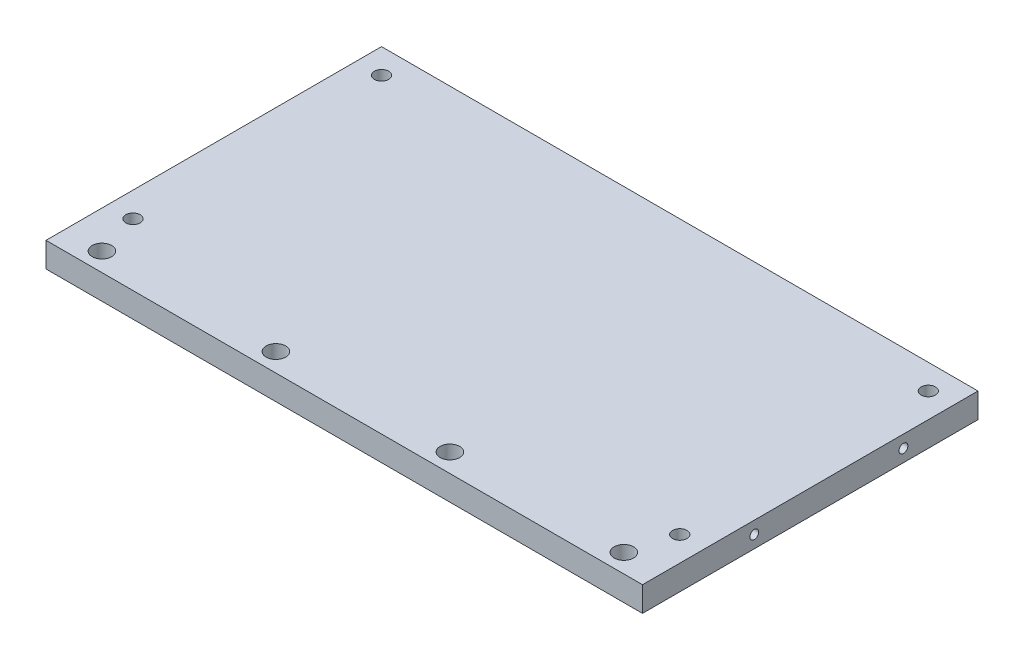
from build123d import *

# Parameters (mm, degrees)
SKETCH1_W          = 152.4
SKETCH1_H          = 85.725
EXTRUDE1_DEPTH     = 6.35
SKETCH2_R          = 1.8288
CUT_EXTRUDE1_DEPTH = 175.971020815
SKETCH3_R          = 2.4892
CUT_EXTRUDE2_DEPTH = 175.971020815
SKETCH4_R          = 1.1303
CUT_EXTRUDE3_DEPTH = 12.7
SKETCH5_R          = 1.1303
CUT_EXTRUDE4_DEPTH = 12.7
CUT_EXTRUDE5_START = -12.7
SKETCH6_R          = 1.1303
CUT_EXTRUDE5_DEPTH = 12.7


with BuildPart() as part:
    # Sketch1 → Extrude1 (new body)
    with BuildSketch(Plane(origin=(0, 0, 0), x_dir=(1, 0, 0), z_dir=(0, 1, 0))):
        with Locations((76.2, 42.8625)):
            Rectangle(SKETCH1_W, SKETCH1_H)
    extrude(amount=EXTRUDE1_DEPTH)

    # Sketch2 → Cut-Extrude1 (cut, through all)
    with BuildSketch(Plane(origin=(0, 6.35, 0), x_dir=(-1, 0, 0), z_dir=(0, 1, 0))):
        with Locations(Location((-6.35, -79.375, 0), (0, 0, 90))):
            Circle(SKETCH2_R)
        with Locations(Location((-146.05, -79.375, 0), (0, 0, 90))):
            Circle(SKETCH2_R)
        with Locations(Location((-6.35, -15.875, 0), (0, 0, 90))):
            Circle(SKETCH2_R)
        with Locations(Location((-146.05, -15.875, 0), (0, 0, 90))):
            Circle(SKETCH2_R)
    extrude(amount=-CUT_EXTRUDE1_DEPTH, mode=Mode.SUBTRACT)

    # Sketch3 → Cut-Extrude2 (cut, through all)
    with BuildSketch(Plane(origin=(0, 6.35, 0), x_dir=(-1, 0, 0), z_dir=(0, 1, 0))):
        with Locations(Location((-9.525, -4.7625, 0), (0, 0, 90))):
            Circle(SKETCH3_R)
        with Locations(Location((-53.975, -4.7625, 0), (0, 0, 90))):
            Circle(SKETCH3_R)
        with Locations(Location((-98.425, -4.7625, 0), (0, 0, 90))):
            Circle(SKETCH3_R)
        with Locations(Location((-142.875, -4.7625, 0), (0, 0, 90))):
            Circle(SKETCH3_R)
    extrude(amount=-CUT_EXTRUDE2_DEPTH, mode=Mode.SUBTRACT)

    # Sketch4 → Cut-Extrude3 (cut)
    with BuildSketch(Plane(origin=(152.4, 0, 0), x_dir=(0, 0, -1), z_dir=(1, 0, 0))):
        with Locations((28.575, 3.175)):
            Circle(SKETCH4_R)
        with Locations((66.675, 3.175)):
            Circle(SKETCH4_R)
    extrude(amount=-CUT_EXTRUDE3_DEPTH, mode=Mode.SUBTRACT)

    # Sketch5 → Cut-Extrude4 (cut)
    with BuildSketch(Plane(origin=(0, 0, -85.725), x_dir=(-1, 0, 0), z_dir=(0, 0, -1))):
        with Locations((-142.875, 3.175)):
            Circle(SKETCH5_R)
        with Locations((-98.425, 3.175)):
            Circle(SKETCH5_R)
        with Locations((-53.975, 3.175)):
            Circle(SKETCH5_R)
        with Locations((-9.525, 3.175)):
            Circle(SKETCH5_R)
    extrude(amount=-CUT_EXTRUDE4_DEPTH, mode=Mode.SUBTRACT)

    # Sketch6 → Cut-Extrude5 (cut)
    with BuildSketch(Plane.ZY.offset(CUT_EXTRUDE5_START)):
        with Locations(Location((-66.675, 3.175, 0), (0, 0, 180))):
            Circle(SKETCH6_R)
        with Locations(Location((-28.575, 3.175, 0), (0, 0, 180))):
            Circle(SKETCH6_R)
    extrude(amount=CUT_EXTRUDE5_DEPTH, mode=Mode.SUBTRACT)


solid = part.part
